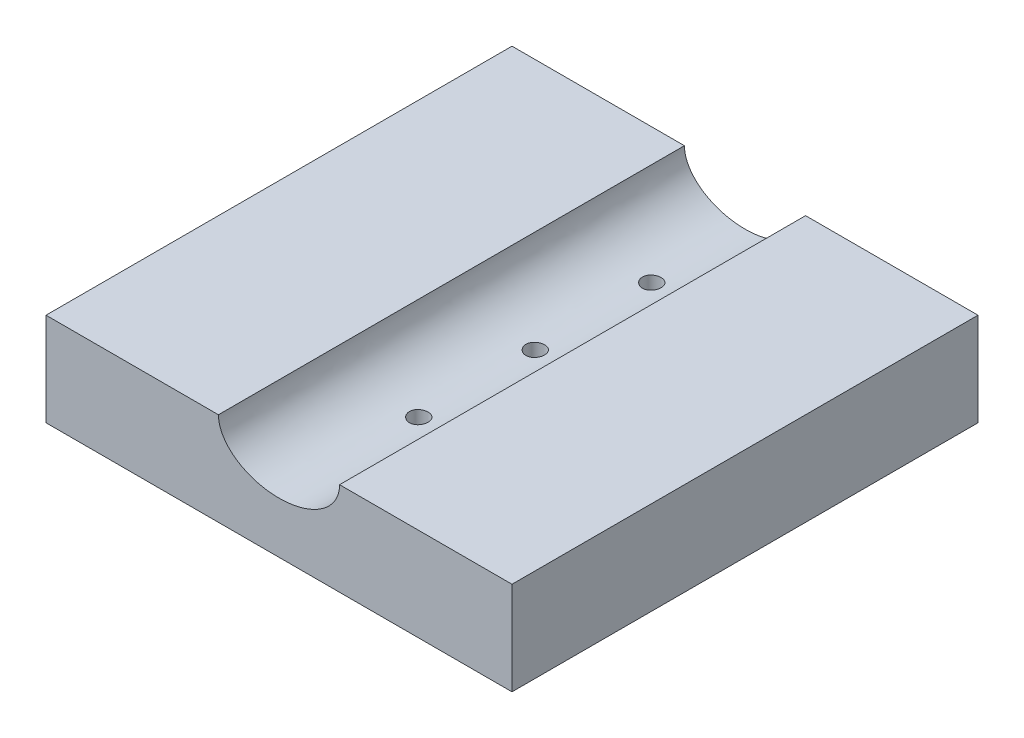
ISO-10303-21;
HEADER;
FILE_DESCRIPTION(('STEP AP214'),'2;1');
FILE_NAME('part.step','',(''),(''),'','','');
FILE_SCHEMA(('AUTOMOTIVE_DESIGN { 1 0 10303 214 1 1 1 1 }'));
ENDSEC;
DATA;
#1=APPLICATION_CONTEXT('core data for automotive mechanical design processes');
#2=APPLICATION_PROTOCOL_DEFINITION('international standard','automotive_design',2000,#1);
#3=PRODUCT_CONTEXT('',#1,'mechanical');
#4=PRODUCT('Part','Part','',(#3));
#5=PRODUCT_RELATED_PRODUCT_CATEGORY('part','',(#4));
#6=PRODUCT_DEFINITION_FORMATION('','',#4);
#7=PRODUCT_DEFINITION_CONTEXT('part definition',#1,'design');
#8=PRODUCT_DEFINITION('design','',#6,#7);
#9=PRODUCT_DEFINITION_SHAPE('','',#8);
#10=(LENGTH_UNIT() NAMED_UNIT(*) SI_UNIT(.MILLI.,.METRE.));
#11=(NAMED_UNIT(*) PLANE_ANGLE_UNIT() SI_UNIT($,.RADIAN.));
#12=(NAMED_UNIT(*) SI_UNIT($,.STERADIAN.) SOLID_ANGLE_UNIT());
#13=UNCERTAINTY_MEASURE_WITH_UNIT(LENGTH_MEASURE(1.E-05),#10,'distance_accuracy_value','');
#14=(GEOMETRIC_REPRESENTATION_CONTEXT(3) GLOBAL_UNCERTAINTY_ASSIGNED_CONTEXT((#13)) GLOBAL_UNIT_ASSIGNED_CONTEXT((#10,
#11,#12)) REPRESENTATION_CONTEXT('',''));
#15=CARTESIAN_POINT('',(0.,0.,0.));
#16=DIRECTION('',(0.,0.,1.));
#17=DIRECTION('',(1.,0.,0.));
#18=AXIS2_PLACEMENT_3D('',#15,#16,#17);
#19=CARTESIAN_POINT('',(-13.,0.,100.));
#20=DIRECTION('',(0.,-1.,0.));
#21=DIRECTION('',(1.,0.,0.));
#22=AXIS2_PLACEMENT_3D('',#19,#20,#21);
#23=PLANE('',#22);
#24=DIRECTION('',(-1.,0.,0.));
#25=VECTOR('',#24,1.);
#26=CARTESIAN_POINT('',(-13.,0.,0.));
#27=LINE('',#26,#25);
#28=CARTESIAN_POINT('',(-13.,0.,0.));
#29=VERTEX_POINT('',#28);
#30=CARTESIAN_POINT('',(-50.,0.,0.));
#31=VERTEX_POINT('',#30);
#32=EDGE_CURVE('E129',#29,#31,#27,.T.);
#33=ORIENTED_EDGE('',*,*,#32,.T.);
#34=DIRECTION('',(0.,0.,-1.));
#35=VECTOR('',#34,1.);
#36=CARTESIAN_POINT('',(-50.,0.,100.));
#37=LINE('',#36,#35);
#38=CARTESIAN_POINT('',(-50.,0.,100.));
#39=VERTEX_POINT('',#38);
#40=EDGE_CURVE('E11',#39,#31,#37,.T.);
#41=ORIENTED_EDGE('',*,*,#40,.F.);
#42=DIRECTION('',(-1.,0.,0.));
#43=VECTOR('',#42,1.);
#44=CARTESIAN_POINT('',(-13.,0.,100.));
#45=LINE('',#44,#43);
#46=CARTESIAN_POINT('',(-13.,0.,100.));
#47=VERTEX_POINT('',#46);
#48=EDGE_CURVE('E197',#47,#39,#45,.T.);
#49=ORIENTED_EDGE('',*,*,#48,.F.);
#50=DIRECTION('',(0.,0.,-1.));
#51=VECTOR('',#50,1.);
#52=CARTESIAN_POINT('',(-13.,0.,100.));
#53=LINE('',#52,#51);
#54=EDGE_CURVE('E124',#47,#29,#53,.T.);
#55=ORIENTED_EDGE('',*,*,#54,.T.);
#56=EDGE_LOOP('',(#33,#41,#49,#55));
#57=FACE_BOUND('',#56,.T.);
#58=ADVANCED_FACE('F37',(#57),#23,.F.);
#59=CARTESIAN_POINT('',(-50.,-20.,100.));
#60=DIRECTION('',(1.,0.,0.));
#61=DIRECTION('',(0.,1.,0.));
#62=AXIS2_PLACEMENT_3D('',#59,#60,#61);
#63=PLANE('',#62);
#64=DIRECTION('',(0.,-1.,0.));
#65=VECTOR('',#64,1.);
#66=CARTESIAN_POINT('',(-50.,-20.,0.));
#67=LINE('',#66,#65);
#68=CARTESIAN_POINT('',(-50.,-20.,0.));
#69=VERTEX_POINT('',#68);
#70=EDGE_CURVE('E182',#31,#69,#67,.T.);
#71=ORIENTED_EDGE('',*,*,#70,.T.);
#72=DIRECTION('',(0.,0.,-1.));
#73=VECTOR('',#72,1.);
#74=CARTESIAN_POINT('',(-50.,-20.,100.));
#75=LINE('',#74,#73);
#76=CARTESIAN_POINT('',(-50.,-20.,100.));
#77=VERTEX_POINT('',#76);
#78=EDGE_CURVE('E51',#77,#69,#75,.T.);
#79=ORIENTED_EDGE('',*,*,#78,.F.);
#80=DIRECTION('',(0.,-1.,0.));
#81=VECTOR('',#80,1.);
#82=CARTESIAN_POINT('',(-50.,-20.,100.));
#83=LINE('',#82,#81);
#84=EDGE_CURVE('E97',#39,#77,#83,.T.);
#85=ORIENTED_EDGE('',*,*,#84,.F.);
#86=ORIENTED_EDGE('',*,*,#40,.T.);
#87=EDGE_LOOP('',(#71,#79,#85,#86));
#88=FACE_BOUND('',#87,.T.);
#89=ADVANCED_FACE('F172',(#88),#63,.F.);
#90=CARTESIAN_POINT('',(50.,-20.,100.));
#91=DIRECTION('',(0.,1.,0.));
#92=DIRECTION('',(-1.,0.,0.));
#93=AXIS2_PLACEMENT_3D('',#90,#91,#92);
#94=PLANE('',#93);
#95=CARTESIAN_POINT('',(0.,-20.,45.));
#96=DIRECTION('',(0.,1.,0.));
#97=DIRECTION('',(0.,0.,1.));
#98=AXIS2_PLACEMENT_3D('',#95,#96,#97);
#99=CIRCLE('',#98,2.);
#100=CARTESIAN_POINT('',(0.,-20.,47.));
#101=VERTEX_POINT('',#100);
#102=EDGE_CURVE('E154',#101,#101,#99,.T.);
#103=ORIENTED_EDGE('',*,*,#102,.T.);
#104=EDGE_LOOP('',(#103));
#105=FACE_BOUND('',#104,.T.);
#106=CARTESIAN_POINT('',(0.,-20.,70.));
#107=DIRECTION('',(0.,1.,0.));
#108=DIRECTION('',(0.,0.,1.));
#109=AXIS2_PLACEMENT_3D('',#106,#107,#108);
#110=CIRCLE('',#109,2.);
#111=CARTESIAN_POINT('',(0.,-20.,72.));
#112=VERTEX_POINT('',#111);
#113=EDGE_CURVE('E195',#112,#112,#110,.T.);
#114=ORIENTED_EDGE('',*,*,#113,.T.);
#115=EDGE_LOOP('',(#114));
#116=FACE_BOUND('',#115,.T.);
#117=CARTESIAN_POINT('',(0.,-20.,20.));
#118=DIRECTION('',(0.,1.,0.));
#119=DIRECTION('',(0.,0.,1.));
#120=AXIS2_PLACEMENT_3D('',#117,#118,#119);
#121=CIRCLE('',#120,2.);
#122=CARTESIAN_POINT('',(0.,-20.,22.));
#123=VERTEX_POINT('',#122);
#124=EDGE_CURVE('E185',#123,#123,#121,.T.);
#125=ORIENTED_EDGE('',*,*,#124,.T.);
#126=EDGE_LOOP('',(#125));
#127=FACE_BOUND('',#126,.T.);
#128=DIRECTION('',(1.,0.,0.));
#129=VECTOR('',#128,1.);
#130=CARTESIAN_POINT('',(50.,-20.,0.));
#131=LINE('',#130,#129);
#132=CARTESIAN_POINT('',(50.,-20.,0.));
#133=VERTEX_POINT('',#132);
#134=EDGE_CURVE('E183',#69,#133,#131,.T.);
#135=ORIENTED_EDGE('',*,*,#134,.T.);
#136=DIRECTION('',(0.,0.,-1.));
#137=VECTOR('',#136,1.);
#138=CARTESIAN_POINT('',(50.,-20.,100.));
#139=LINE('',#138,#137);
#140=CARTESIAN_POINT('',(50.,-20.,100.));
#141=VERTEX_POINT('',#140);
#142=EDGE_CURVE('E119',#141,#133,#139,.T.);
#143=ORIENTED_EDGE('',*,*,#142,.F.);
#144=DIRECTION('',(1.,0.,0.));
#145=VECTOR('',#144,1.);
#146=CARTESIAN_POINT('',(50.,-20.,100.));
#147=LINE('',#146,#145);
#148=EDGE_CURVE('E110',#77,#141,#147,.T.);
#149=ORIENTED_EDGE('',*,*,#148,.F.);
#150=ORIENTED_EDGE('',*,*,#78,.T.);
#151=EDGE_LOOP('',(#135,#143,#149,#150));
#152=FACE_BOUND('',#151,.T.);
#153=ADVANCED_FACE('F177',(#105,#116,#127,#152),#94,.F.);
#154=CARTESIAN_POINT('',(50.,-20.,100.));
#155=DIRECTION('',(-1.,0.,0.));
#156=DIRECTION('',(0.,0.,1.));
#157=AXIS2_PLACEMENT_3D('',#154,#155,#156);
#158=PLANE('',#157);
#159=DIRECTION('',(0.,1.,0.));
#160=VECTOR('',#159,1.);
#161=CARTESIAN_POINT('',(50.,-20.,0.));
#162=LINE('',#161,#160);
#163=CARTESIAN_POINT('',(50.,0.,0.));
#164=VERTEX_POINT('',#163);
#165=EDGE_CURVE('E118',#133,#164,#162,.T.);
#166=ORIENTED_EDGE('',*,*,#165,.T.);
#167=DIRECTION('',(0.,0.,-1.));
#168=VECTOR('',#167,1.);
#169=CARTESIAN_POINT('',(50.,0.,100.));
#170=LINE('',#169,#168);
#171=CARTESIAN_POINT('',(50.,0.,100.));
#172=VERTEX_POINT('',#171);
#173=EDGE_CURVE('E115',#172,#164,#170,.T.);
#174=ORIENTED_EDGE('',*,*,#173,.F.);
#175=DIRECTION('',(0.,1.,0.));
#176=VECTOR('',#175,1.);
#177=CARTESIAN_POINT('',(50.,-20.,100.));
#178=LINE('',#177,#176);
#179=EDGE_CURVE('E104',#141,#172,#178,.T.);
#180=ORIENTED_EDGE('',*,*,#179,.F.);
#181=ORIENTED_EDGE('',*,*,#142,.T.);
#182=EDGE_LOOP('',(#166,#174,#180,#181));
#183=FACE_BOUND('',#182,.T.);
#184=ADVANCED_FACE('F116',(#183),#158,.F.);
#185=CARTESIAN_POINT('',(50.,0.,100.));
#186=DIRECTION('',(0.,-1.,0.));
#187=DIRECTION('',(1.,0.,0.));
#188=AXIS2_PLACEMENT_3D('',#185,#186,#187);
#189=PLANE('',#188);
#190=DIRECTION('',(-1.,0.,0.));
#191=VECTOR('',#190,1.);
#192=CARTESIAN_POINT('',(50.,0.,0.));
#193=LINE('',#192,#191);
#194=CARTESIAN_POINT('',(13.,0.,0.));
#195=VERTEX_POINT('',#194);
#196=EDGE_CURVE('E83',#164,#195,#193,.T.);
#197=ORIENTED_EDGE('',*,*,#196,.T.);
#198=DIRECTION('',(0.,0.,-1.));
#199=VECTOR('',#198,1.);
#200=CARTESIAN_POINT('',(13.,0.,100.));
#201=LINE('',#200,#199);
#202=CARTESIAN_POINT('',(13.,0.,100.));
#203=VERTEX_POINT('',#202);
#204=EDGE_CURVE('E120',#203,#195,#201,.T.);
#205=ORIENTED_EDGE('',*,*,#204,.F.);
#206=DIRECTION('',(-1.,0.,0.));
#207=VECTOR('',#206,1.);
#208=CARTESIAN_POINT('',(50.,0.,100.));
#209=LINE('',#208,#207);
#210=EDGE_CURVE('E108',#172,#203,#209,.T.);
#211=ORIENTED_EDGE('',*,*,#210,.F.);
#212=ORIENTED_EDGE('',*,*,#173,.T.);
#213=EDGE_LOOP('',(#197,#205,#211,#212));
#214=FACE_BOUND('',#213,.T.);
#215=ADVANCED_FACE('F122',(#214),#189,.F.);
#216=CARTESIAN_POINT('',(0.,0.,100.));
#217=DIRECTION('',(0.,0.,-1.));
#218=DIRECTION('',(1.,0.,0.));
#219=AXIS2_PLACEMENT_3D('',#216,#217,#218);
#220=ELLIPSE('',#219,13.,9.);
#221=DIRECTION('',(0.,0.,-1.));
#222=VECTOR('',#221,1.);
#223=SURFACE_OF_LINEAR_EXTRUSION('',#220,#222);
#224=CARTESIAN_POINT('',(0.,-9.,47.));
#225=CARTESIAN_POINT('',(-0.111999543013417,-8.99999864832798,46.9999951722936));
#226=CARTESIAN_POINT('',(-0.224072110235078,-8.99898743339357,46.9905603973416));
#227=CARTESIAN_POINT('',(-0.445107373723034,-8.99504972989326,46.9530672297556));
#228=CARTESIAN_POINT('',(-0.554066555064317,-8.99212115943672,46.9249885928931));
#229=CARTESIAN_POINT('',(-0.765642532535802,-8.98467647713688,46.8510368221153));
#230=CARTESIAN_POINT('',(-0.868263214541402,-8.98016134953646,46.8051747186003));
#231=CARTESIAN_POINT('',(-1.064328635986,-8.97004462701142,46.6969801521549));
#232=CARTESIAN_POINT('',(-1.15777513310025,-8.96444324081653,46.6346508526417));
#233=CARTESIAN_POINT('',(-1.3332401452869,-8.95275326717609,46.4950205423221));
#234=CARTESIAN_POINT('',(-1.41521621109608,-8.94666299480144,46.4176663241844));
#235=CARTESIAN_POINT('',(-1.56504873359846,-8.93469480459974,46.2502956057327));
#236=CARTESIAN_POINT('',(-1.63290451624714,-8.92881689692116,46.1602785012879));
#237=CARTESIAN_POINT('',(-1.75272513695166,-8.91792355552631,45.969865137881));
#238=CARTESIAN_POINT('',(-1.80465064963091,-8.91291026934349,45.8694439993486));
#239=CARTESIAN_POINT('',(-1.89088593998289,-8.90433816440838,45.6612451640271));
#240=CARTESIAN_POINT('',(-1.92519621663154,-8.90077930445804,45.5534676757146));
#241=CARTESIAN_POINT('',(-1.97509951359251,-8.89553757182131,45.334053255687));
#242=CARTESIAN_POINT('',(-1.99076374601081,-8.8938475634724,45.2224326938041));
#243=CARTESIAN_POINT('',(-2.00315035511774,-8.89251458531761,44.9981351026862));
#244=CARTESIAN_POINT('',(-1.99987330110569,-8.89287155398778,44.8854581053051));
#245=CARTESIAN_POINT('',(-1.97452955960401,-8.89558522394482,44.6627431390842));
#246=CARTESIAN_POINT('',(-1.95254155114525,-8.89793355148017,44.5526961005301));
#247=CARTESIAN_POINT('',(-1.89052247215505,-8.90434998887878,44.3378630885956));
#248=CARTESIAN_POINT('',(-1.8504911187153,-8.90841812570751,44.2330771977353));
#249=CARTESIAN_POINT('',(-1.75343506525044,-8.91782225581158,44.0314931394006));
#250=CARTESIAN_POINT('',(-1.69637558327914,-8.92316083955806,43.934711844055));
#251=CARTESIAN_POINT('',(-1.5669077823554,-8.93449949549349,43.7520692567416));
#252=CARTESIAN_POINT('',(-1.49449895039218,-8.94049958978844,43.6662083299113));
#253=CARTESIAN_POINT('',(-1.33595118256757,-8.95252121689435,43.507388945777));
#254=CARTESIAN_POINT('',(-1.24974463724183,-8.95854270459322,43.4344979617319));
#255=CARTESIAN_POINT('',(-1.06628301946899,-8.96990107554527,43.3042115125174));
#256=CARTESIAN_POINT('',(-0.969027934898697,-8.97523795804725,43.246816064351));
#257=CARTESIAN_POINT('',(-0.766185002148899,-8.98463050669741,43.1491534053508));
#258=CARTESIAN_POINT('',(-0.660595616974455,-8.98868593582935,43.1088893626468));
#259=CARTESIAN_POINT('',(-0.444102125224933,-8.9950593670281,43.0466805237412));
#260=CARTESIAN_POINT('',(-0.333198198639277,-8.99737742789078,43.0247351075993));
#261=CARTESIAN_POINT('',(-0.109802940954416,-9.00000959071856,42.9998717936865));
#262=CARTESIAN_POINT('',(0.00267801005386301,-9.00033341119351,42.9968616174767));
#263=CARTESIAN_POINT('',(0.226542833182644,-8.99896704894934,43.0097115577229));
#264=CARTESIAN_POINT('',(0.337926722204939,-8.9972768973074,43.025571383));
#265=CARTESIAN_POINT('',(0.556169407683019,-8.99207695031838,43.0756349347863));
#266=CARTESIAN_POINT('',(0.663038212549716,-8.98857143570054,43.1097955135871));
#267=CARTESIAN_POINT('',(0.869528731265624,-8.98013086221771,43.1954462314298));
#268=CARTESIAN_POINT('',(0.96915026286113,-8.97519576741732,43.2469368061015));
#269=CARTESIAN_POINT('',(1.15873220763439,-8.96442047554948,43.3660119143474));
#270=CARTESIAN_POINT('',(1.2486546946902,-8.9585769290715,43.4336565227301));
#271=CARTESIAN_POINT('',(1.41590201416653,-8.94664877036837,43.5830336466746));
#272=CARTESIAN_POINT('',(1.49322648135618,-8.9405641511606,43.6647665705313));
#273=CARTESIAN_POINT('',(1.63340630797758,-8.92881026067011,43.8404052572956));
#274=CARTESIAN_POINT('',(1.69620072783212,-8.92314280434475,43.934359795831));
#275=CARTESIAN_POINT('',(1.80511877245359,-8.91289572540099,44.1315353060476));
#276=CARTESIAN_POINT('',(1.85124265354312,-8.90831608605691,44.2347561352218));
#277=CARTESIAN_POINT('',(1.92540994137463,-8.90077814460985,44.4473306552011));
#278=CARTESIAN_POINT('',(1.95348878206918,-8.89781666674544,44.5566718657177));
#279=CARTESIAN_POINT('',(1.9908832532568,-8.89384354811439,44.7785505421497));
#280=CARTESIAN_POINT('',(2.00019951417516,-8.89283184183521,44.8910879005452));
#281=CARTESIAN_POINT('',(1.99979501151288,-8.89287539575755,45.115554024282));
#282=CARTESIAN_POINT('',(1.99017068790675,-8.89392018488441,45.2274829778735));
#283=CARTESIAN_POINT('',(1.95236091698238,-8.8979355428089,45.4481238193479));
#284=CARTESIAN_POINT('',(1.92417544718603,-8.90090611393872,45.5568357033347));
#285=CARTESIAN_POINT('',(1.85007093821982,-8.90843260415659,45.7679526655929));
#286=CARTESIAN_POINT('',(1.80415520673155,-8.91298822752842,45.8703589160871));
#287=CARTESIAN_POINT('',(1.69590310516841,-8.92316894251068,46.0660273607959));
#288=CARTESIAN_POINT('',(1.63356674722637,-8.9287940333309,46.1592895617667));
#289=CARTESIAN_POINT('',(1.49388122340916,-8.94051200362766,46.3345166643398));
#290=CARTESIAN_POINT('',(1.4164600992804,-8.94660703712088,46.4164240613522));
#291=CARTESIAN_POINT('',(1.24894832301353,-8.95855790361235,46.5661248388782));
#292=CARTESIAN_POINT('',(1.15885465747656,-8.96441367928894,46.6339148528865));
#293=CARTESIAN_POINT('',(0.968273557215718,-8.97524543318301,46.7536101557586));
#294=CARTESIAN_POINT('',(0.8677575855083,-8.98021888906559,46.8054702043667));
#295=CARTESIAN_POINT('',(0.659453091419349,-8.98870198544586,46.8915052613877));
#296=CARTESIAN_POINT('',(0.551672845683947,-8.99221326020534,46.9257000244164));
#297=CARTESIAN_POINT('',(0.369412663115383,-8.99650621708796,46.9669930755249));
#298=CARTESIAN_POINT('',(0.296094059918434,-8.99781026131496,46.9793535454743));
#299=CARTESIAN_POINT('',(0.148527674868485,-8.99955759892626,46.9958585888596));
#300=CARTESIAN_POINT('',(0.0742798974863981,-9.00000089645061,47.0000032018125));
#301=CARTESIAN_POINT('',(0.,-9.,47.));
#302=B_SPLINE_CURVE_WITH_KNOTS('',3,(#224,#225,#226,#227,#228,#229,#230,#231,#232,#233,#234,
#235,#236,#237,#238,#239,#240,#241,#242,#243,#244,#245,#246,#247,#248,#249,#250,#251,#252,#253,
#254,#255,#256,#257,#258,#259,#260,#261,#262,#263,#264,#265,#266,#267,#268,#269,#270,#271,#272,
#273,#274,#275,#276,#277,#278,#279,#280,#281,#282,#283,#284,#285,#286,#287,#288,#289,#290,#291,
#292,#293,#294,#295,#296,#297,#298,#299,#300,#301),.UNSPECIFIED.,.T.,.F.,(4,2,2,2,2,2,2,2,2,2,2,
2,2,2,2,2,2,2,2,2,2,2,2,2,2,2,2,2,2,2,2,2,2,2,2,2,2,2,4),(0.,0.335727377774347,0.67181989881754,
1.00770428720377,1.34352419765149,1.68055576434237,2.01760341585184,2.3554765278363,
2.69334006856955,3.02990907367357,3.36646796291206,3.70161858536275,4.03677446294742,
4.37261967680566,4.70847611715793,5.04603170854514,5.38358767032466,5.72120602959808,
6.05881296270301,6.39477332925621,6.73072851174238,7.06589507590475,7.4010700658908,
7.73751149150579,8.07396266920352,8.41180034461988,8.74963282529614,9.08679988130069,
9.42395560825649,9.75939907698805,10.0948429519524,10.4302242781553,10.7656053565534,
11.1026272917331,11.4397295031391,11.7777803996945,12.1154524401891,12.3381133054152,
12.5607730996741),.UNSPECIFIED.);
#303=CARTESIAN_POINT('',(0.,-9.,47.));
#304=VERTEX_POINT('',#303);
#305=EDGE_CURVE('E40',#304,#304,#302,.T.);
#306=ORIENTED_EDGE('',*,*,#305,.T.);
#307=EDGE_LOOP('',(#306));
#308=FACE_BOUND('',#307,.T.);
#309=CARTESIAN_POINT('',(0.,-9.,72.));
#310=CARTESIAN_POINT('',(-0.111999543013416,-8.99999864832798,71.9999951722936));
#311=CARTESIAN_POINT('',(-0.224072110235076,-8.99898743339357,71.9905603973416));
#312=CARTESIAN_POINT('',(-0.445107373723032,-8.99504972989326,71.9530672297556));
#313=CARTESIAN_POINT('',(-0.554066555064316,-8.99212115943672,71.9249885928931));
#314=CARTESIAN_POINT('',(-0.765642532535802,-8.98467647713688,71.8510368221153));
#315=CARTESIAN_POINT('',(-0.868263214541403,-8.98016134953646,71.8051747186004));
#316=CARTESIAN_POINT('',(-1.064328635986,-8.97004462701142,71.6969801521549));
#317=CARTESIAN_POINT('',(-1.15777513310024,-8.96444324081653,71.6346508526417));
#318=CARTESIAN_POINT('',(-1.33324014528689,-8.95275326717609,71.4950205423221));
#319=CARTESIAN_POINT('',(-1.41521621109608,-8.94666299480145,71.4176663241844));
#320=CARTESIAN_POINT('',(-1.56504873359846,-8.93469480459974,71.2502956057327));
#321=CARTESIAN_POINT('',(-1.63290451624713,-8.92881689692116,71.1602785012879));
#322=CARTESIAN_POINT('',(-1.75272513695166,-8.9179235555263,70.9698651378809));
#323=CARTESIAN_POINT('',(-1.80465064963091,-8.91291026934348,70.8694439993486));
#324=CARTESIAN_POINT('',(-1.8908859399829,-8.90433816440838,70.6612451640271));
#325=CARTESIAN_POINT('',(-1.92519621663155,-8.90077930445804,70.5534676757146));
#326=CARTESIAN_POINT('',(-1.97509951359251,-8.89553757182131,70.334053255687));
#327=CARTESIAN_POINT('',(-1.99076374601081,-8.8938475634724,70.2224326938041));
#328=CARTESIAN_POINT('',(-2.00315035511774,-8.89251458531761,69.9981351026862));
#329=CARTESIAN_POINT('',(-1.99987330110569,-8.89287155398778,69.8854581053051));
#330=CARTESIAN_POINT('',(-1.97452955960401,-8.89558522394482,69.6627431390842));
#331=CARTESIAN_POINT('',(-1.95254155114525,-8.89793355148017,69.5526961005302));
#332=CARTESIAN_POINT('',(-1.89052247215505,-8.90434998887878,69.3378630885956));
#333=CARTESIAN_POINT('',(-1.8504911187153,-8.90841812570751,69.2330771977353));
#334=CARTESIAN_POINT('',(-1.75343506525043,-8.91782225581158,69.0314931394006));
#335=CARTESIAN_POINT('',(-1.69637558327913,-8.92316083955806,68.934711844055));
#336=CARTESIAN_POINT('',(-1.5669077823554,-8.93449949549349,68.7520692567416));
#337=CARTESIAN_POINT('',(-1.49449895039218,-8.94049958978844,68.6662083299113));
#338=CARTESIAN_POINT('',(-1.33595118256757,-8.95252121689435,68.507388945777));
#339=CARTESIAN_POINT('',(-1.24974463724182,-8.95854270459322,68.4344979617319));
#340=CARTESIAN_POINT('',(-1.06628301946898,-8.96990107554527,68.3042115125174));
#341=CARTESIAN_POINT('',(-0.969027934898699,-8.97523795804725,68.246816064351));
#342=CARTESIAN_POINT('',(-0.766185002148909,-8.98463050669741,68.1491534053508));
#343=CARTESIAN_POINT('',(-0.660595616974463,-8.98868593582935,68.1088893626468));
#344=CARTESIAN_POINT('',(-0.444102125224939,-8.9950593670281,68.0466805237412));
#345=CARTESIAN_POINT('',(-0.333198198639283,-8.99737742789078,68.0247351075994));
#346=CARTESIAN_POINT('',(-0.109802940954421,-9.00000959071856,67.9998717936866));
#347=CARTESIAN_POINT('',(0.00267801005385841,-9.00033341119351,67.9968616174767));
#348=CARTESIAN_POINT('',(0.22654283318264,-8.99896704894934,68.0097115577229));
#349=CARTESIAN_POINT('',(0.337926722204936,-8.9972768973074,68.025571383));
#350=CARTESIAN_POINT('',(0.556169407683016,-8.99207695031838,68.0756349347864));
#351=CARTESIAN_POINT('',(0.663038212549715,-8.98857143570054,68.1097955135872));
#352=CARTESIAN_POINT('',(0.869528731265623,-8.98013086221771,68.1954462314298));
#353=CARTESIAN_POINT('',(0.969150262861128,-8.97519576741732,68.2469368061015));
#354=CARTESIAN_POINT('',(1.15873220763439,-8.96442047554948,68.3660119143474));
#355=CARTESIAN_POINT('',(1.2486546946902,-8.9585769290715,68.4336565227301));
#356=CARTESIAN_POINT('',(1.41590201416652,-8.94664877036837,68.5830336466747));
#357=CARTESIAN_POINT('',(1.49322648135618,-8.94056415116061,68.6647665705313));
#358=CARTESIAN_POINT('',(1.63340630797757,-8.92881026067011,68.8404052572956));
#359=CARTESIAN_POINT('',(1.69620072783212,-8.92314280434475,68.934359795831));
#360=CARTESIAN_POINT('',(1.80511877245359,-8.91289572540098,69.1315353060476));
#361=CARTESIAN_POINT('',(1.85124265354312,-8.90831608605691,69.2347561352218));
#362=CARTESIAN_POINT('',(1.92540994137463,-8.90077814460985,69.4473306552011));
#363=CARTESIAN_POINT('',(1.95348878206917,-8.89781666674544,69.5566718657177));
#364=CARTESIAN_POINT('',(1.9908832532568,-8.89384354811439,69.7785505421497));
#365=CARTESIAN_POINT('',(2.00019951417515,-8.89283184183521,69.8910879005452));
#366=CARTESIAN_POINT('',(1.99979501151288,-8.89287539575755,70.115554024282));
#367=CARTESIAN_POINT('',(1.99017068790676,-8.89392018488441,70.2274829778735));
#368=CARTESIAN_POINT('',(1.95236091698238,-8.8979355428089,70.4481238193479));
#369=CARTESIAN_POINT('',(1.92417544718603,-8.90090611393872,70.5568357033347));
#370=CARTESIAN_POINT('',(1.85007093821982,-8.90843260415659,70.7679526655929));
#371=CARTESIAN_POINT('',(1.80415520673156,-8.91298822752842,70.8703589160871));
#372=CARTESIAN_POINT('',(1.69590310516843,-8.92316894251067,71.0660273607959));
#373=CARTESIAN_POINT('',(1.63356674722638,-8.92879403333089,71.1592895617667));
#374=CARTESIAN_POINT('',(1.49388122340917,-8.94051200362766,71.3345166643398));
#375=CARTESIAN_POINT('',(1.41646009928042,-8.94660703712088,71.4164240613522));
#376=CARTESIAN_POINT('',(1.24894832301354,-8.95855790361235,71.5661248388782));
#377=CARTESIAN_POINT('',(1.15885465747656,-8.96441367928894,71.6339148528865));
#378=CARTESIAN_POINT('',(0.968273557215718,-8.97524543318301,71.7536101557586));
#379=CARTESIAN_POINT('',(0.867757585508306,-8.98021888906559,71.8054702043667));
#380=CARTESIAN_POINT('',(0.659453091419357,-8.98870198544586,71.8915052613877));
#381=CARTESIAN_POINT('',(0.551672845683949,-8.99221326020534,71.9257000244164));
#382=CARTESIAN_POINT('',(0.369412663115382,-8.99650621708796,71.9669930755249));
#383=CARTESIAN_POINT('',(0.296094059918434,-8.99781026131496,71.9793535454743));
#384=CARTESIAN_POINT('',(0.148527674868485,-8.99955759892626,71.9958585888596));
#385=CARTESIAN_POINT('',(0.0742798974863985,-9.00000089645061,72.0000032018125));
#386=CARTESIAN_POINT('',(0.,-9.,72.));
#387=B_SPLINE_CURVE_WITH_KNOTS('',3,(#309,#310,#311,#312,#313,#314,#315,#316,#317,#318,#319,
#320,#321,#322,#323,#324,#325,#326,#327,#328,#329,#330,#331,#332,#333,#334,#335,#336,#337,#338,
#339,#340,#341,#342,#343,#344,#345,#346,#347,#348,#349,#350,#351,#352,#353,#354,#355,#356,#357,
#358,#359,#360,#361,#362,#363,#364,#365,#366,#367,#368,#369,#370,#371,#372,#373,#374,#375,#376,
#377,#378,#379,#380,#381,#382,#383,#384,#385,#386),.UNSPECIFIED.,.T.,.F.,(4,2,2,2,2,2,2,2,2,2,2,
2,2,2,2,2,2,2,2,2,2,2,2,2,2,2,2,2,2,2,2,2,2,2,2,2,2,2,4),(0.,0.335727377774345,
0.671819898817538,1.00770428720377,1.34352419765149,1.68055576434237,2.01760341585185,
2.35547652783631,2.69334006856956,3.02990907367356,3.36646796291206,3.70161858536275,
4.03677446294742,4.37261967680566,4.70847611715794,5.04603170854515,5.38358767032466,
5.72120602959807,6.05881296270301,6.39477332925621,6.73072851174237,7.06589507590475,
7.4010700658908,7.73751149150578,8.07396266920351,8.41180034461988,8.74963282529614,
9.08679988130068,9.42395560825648,9.75939907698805,10.0948429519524,10.4302242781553,
10.7656053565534,11.102627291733,11.4397295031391,11.7777803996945,12.1154524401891,
12.3381133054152,12.5607730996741),.UNSPECIFIED.);
#388=CARTESIAN_POINT('',(0.,-9.,72.));
#389=VERTEX_POINT('',#388);
#390=EDGE_CURVE('E148',#389,#389,#387,.T.);
#391=ORIENTED_EDGE('',*,*,#390,.T.);
#392=EDGE_LOOP('',(#391));
#393=FACE_BOUND('',#392,.T.);
#394=CARTESIAN_POINT('',(0.,-9.,22.));
#395=CARTESIAN_POINT('',(-0.111999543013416,-8.99999864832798,21.9999951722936));
#396=CARTESIAN_POINT('',(-0.224072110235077,-8.99898743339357,21.9905603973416));
#397=CARTESIAN_POINT('',(-0.445107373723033,-8.99504972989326,21.9530672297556));
#398=CARTESIAN_POINT('',(-0.554066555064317,-8.99212115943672,21.9249885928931));
#399=CARTESIAN_POINT('',(-0.765642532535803,-8.98467647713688,21.8510368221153));
#400=CARTESIAN_POINT('',(-0.868263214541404,-8.98016134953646,21.8051747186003));
#401=CARTESIAN_POINT('',(-1.06432863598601,-8.97004462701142,21.6969801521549));
#402=CARTESIAN_POINT('',(-1.15777513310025,-8.96444324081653,21.6346508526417));
#403=CARTESIAN_POINT('',(-1.3332401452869,-8.95275326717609,21.495020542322));
#404=CARTESIAN_POINT('',(-1.41521621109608,-8.94666299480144,21.4176663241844));
#405=CARTESIAN_POINT('',(-1.56504873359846,-8.93469480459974,21.2502956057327));
#406=CARTESIAN_POINT('',(-1.63290451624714,-8.92881689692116,21.1602785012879));
#407=CARTESIAN_POINT('',(-1.75272513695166,-8.91792355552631,20.969865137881));
#408=CARTESIAN_POINT('',(-1.80465064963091,-8.91291026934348,20.8694439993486));
#409=CARTESIAN_POINT('',(-1.89088593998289,-8.90433816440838,20.6612451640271));
#410=CARTESIAN_POINT('',(-1.92519621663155,-8.90077930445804,20.5534676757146));
#411=CARTESIAN_POINT('',(-1.97509951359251,-8.89553757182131,20.334053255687));
#412=CARTESIAN_POINT('',(-1.99076374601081,-8.8938475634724,20.2224326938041));
#413=CARTESIAN_POINT('',(-2.00315035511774,-8.89251458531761,19.9981351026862));
#414=CARTESIAN_POINT('',(-1.99987330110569,-8.89287155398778,19.8854581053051));
#415=CARTESIAN_POINT('',(-1.97452955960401,-8.89558522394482,19.6627431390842));
#416=CARTESIAN_POINT('',(-1.95254155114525,-8.89793355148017,19.5526961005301));
#417=CARTESIAN_POINT('',(-1.89052247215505,-8.90434998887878,19.3378630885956));
#418=CARTESIAN_POINT('',(-1.8504911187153,-8.90841812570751,19.2330771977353));
#419=CARTESIAN_POINT('',(-1.75343506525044,-8.91782225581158,19.0314931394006));
#420=CARTESIAN_POINT('',(-1.69637558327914,-8.92316083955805,18.934711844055));
#421=CARTESIAN_POINT('',(-1.5669077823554,-8.93449949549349,18.7520692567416));
#422=CARTESIAN_POINT('',(-1.49449895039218,-8.94049958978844,18.6662083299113));
#423=CARTESIAN_POINT('',(-1.33595118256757,-8.95252121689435,18.507388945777));
#424=CARTESIAN_POINT('',(-1.24974463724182,-8.95854270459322,18.4344979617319));
#425=CARTESIAN_POINT('',(-1.06628301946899,-8.96990107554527,18.3042115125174));
#426=CARTESIAN_POINT('',(-0.969027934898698,-8.97523795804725,18.246816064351));
#427=CARTESIAN_POINT('',(-0.766185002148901,-8.98463050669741,18.1491534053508));
#428=CARTESIAN_POINT('',(-0.660595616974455,-8.98868593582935,18.1088893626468));
#429=CARTESIAN_POINT('',(-0.444102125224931,-8.9950593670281,18.0466805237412));
#430=CARTESIAN_POINT('',(-0.333198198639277,-8.99737742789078,18.0247351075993));
#431=CARTESIAN_POINT('',(-0.109802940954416,-9.00000959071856,17.9998717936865));
#432=CARTESIAN_POINT('',(0.00267801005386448,-9.00033341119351,17.9968616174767));
#433=CARTESIAN_POINT('',(0.226542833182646,-8.99896704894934,18.0097115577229));
#434=CARTESIAN_POINT('',(0.337926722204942,-8.9972768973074,18.025571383));
#435=CARTESIAN_POINT('',(0.556169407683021,-8.99207695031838,18.0756349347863));
#436=CARTESIAN_POINT('',(0.663038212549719,-8.98857143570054,18.1097955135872));
#437=CARTESIAN_POINT('',(0.869528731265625,-8.98013086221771,18.1954462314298));
#438=CARTESIAN_POINT('',(0.96915026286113,-8.97519576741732,18.2469368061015));
#439=CARTESIAN_POINT('',(1.15873220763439,-8.96442047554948,18.3660119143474));
#440=CARTESIAN_POINT('',(1.2486546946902,-8.9585769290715,18.4336565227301));
#441=CARTESIAN_POINT('',(1.41590201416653,-8.94664877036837,18.5830336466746));
#442=CARTESIAN_POINT('',(1.49322648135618,-8.9405641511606,18.6647665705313));
#443=CARTESIAN_POINT('',(1.63340630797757,-8.92881026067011,18.8404052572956));
#444=CARTESIAN_POINT('',(1.69620072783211,-8.92314280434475,18.934359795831));
#445=CARTESIAN_POINT('',(1.80511877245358,-8.91289572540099,19.1315353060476));
#446=CARTESIAN_POINT('',(1.85124265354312,-8.90831608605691,19.2347561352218));
#447=CARTESIAN_POINT('',(1.92540994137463,-8.90077814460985,19.4473306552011));
#448=CARTESIAN_POINT('',(1.95348878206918,-8.89781666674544,19.5566718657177));
#449=CARTESIAN_POINT('',(1.9908832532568,-8.89384354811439,19.7785505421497));
#450=CARTESIAN_POINT('',(2.00019951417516,-8.89283184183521,19.8910879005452));
#451=CARTESIAN_POINT('',(1.99979501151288,-8.89287539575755,20.115554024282));
#452=CARTESIAN_POINT('',(1.99017068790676,-8.89392018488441,20.2274829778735));
#453=CARTESIAN_POINT('',(1.95236091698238,-8.8979355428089,20.4481238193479));
#454=CARTESIAN_POINT('',(1.92417544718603,-8.90090611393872,20.5568357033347));
#455=CARTESIAN_POINT('',(1.85007093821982,-8.90843260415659,20.7679526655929));
#456=CARTESIAN_POINT('',(1.80415520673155,-8.91298822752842,20.8703589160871));
#457=CARTESIAN_POINT('',(1.69590310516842,-8.92316894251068,21.0660273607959));
#458=CARTESIAN_POINT('',(1.63356674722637,-8.9287940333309,21.1592895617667));
#459=CARTESIAN_POINT('',(1.49388122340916,-8.94051200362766,21.3345166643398));
#460=CARTESIAN_POINT('',(1.41646009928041,-8.94660703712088,21.4164240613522));
#461=CARTESIAN_POINT('',(1.24894832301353,-8.95855790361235,21.5661248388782));
#462=CARTESIAN_POINT('',(1.15885465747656,-8.96441367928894,21.6339148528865));
#463=CARTESIAN_POINT('',(0.968273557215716,-8.97524543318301,21.7536101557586));
#464=CARTESIAN_POINT('',(0.867757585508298,-8.98021888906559,21.8054702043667));
#465=CARTESIAN_POINT('',(0.659453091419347,-8.98870198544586,21.8915052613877));
#466=CARTESIAN_POINT('',(0.551672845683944,-8.99221326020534,21.9257000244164));
#467=CARTESIAN_POINT('',(0.36941266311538,-8.99650621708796,21.9669930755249));
#468=CARTESIAN_POINT('',(0.296094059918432,-8.99781026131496,21.9793535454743));
#469=CARTESIAN_POINT('',(0.148527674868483,-8.99955759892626,21.9958585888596));
#470=CARTESIAN_POINT('',(0.0742798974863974,-9.00000089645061,22.0000032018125));
#471=CARTESIAN_POINT('',(0.,-9.,22.));
#472=B_SPLINE_CURVE_WITH_KNOTS('',3,(#394,#395,#396,#397,#398,#399,#400,#401,#402,#403,#404,
#405,#406,#407,#408,#409,#410,#411,#412,#413,#414,#415,#416,#417,#418,#419,#420,#421,#422,#423,
#424,#425,#426,#427,#428,#429,#430,#431,#432,#433,#434,#435,#436,#437,#438,#439,#440,#441,#442,
#443,#444,#445,#446,#447,#448,#449,#450,#451,#452,#453,#454,#455,#456,#457,#458,#459,#460,#461,
#462,#463,#464,#465,#466,#467,#468,#469,#470,#471),.UNSPECIFIED.,.T.,.F.,(4,2,2,2,2,2,2,2,2,2,2,
2,2,2,2,2,2,2,2,2,2,2,2,2,2,2,2,2,2,2,2,2,2,2,2,2,2,2,4),(0.,0.335727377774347,
0.671819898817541,1.00770428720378,1.34352419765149,1.68055576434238,2.01760341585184,
2.35547652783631,2.69334006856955,3.02990907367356,3.36646796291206,3.70161858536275,
4.03677446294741,4.37261967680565,4.70847611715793,5.04603170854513,5.38358767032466,
5.72120602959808,6.05881296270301,6.39477332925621,6.73072851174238,7.06589507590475,
7.4010700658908,7.73751149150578,8.07396266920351,8.41180034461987,8.74963282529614,
9.08679988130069,9.42395560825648,9.75939907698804,10.0948429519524,10.4302242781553,
10.7656053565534,11.102627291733,11.4397295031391,11.7777803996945,12.1154524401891,
12.3381133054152,12.5607730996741),.UNSPECIFIED.);
#473=CARTESIAN_POINT('',(0.,-9.,22.));
#474=VERTEX_POINT('',#473);
#475=EDGE_CURVE('E143',#474,#474,#472,.T.);
#476=ORIENTED_EDGE('',*,*,#475,.T.);
#477=EDGE_LOOP('',(#476));
#478=FACE_BOUND('',#477,.T.);
#479=CARTESIAN_POINT('',(0.,0.,0.));
#480=DIRECTION('',(0.,0.,-1.));
#481=DIRECTION('',(1.,0.,0.));
#482=AXIS2_PLACEMENT_3D('',#479,#480,#481);
#483=ELLIPSE('',#482,13.,9.);
#484=EDGE_CURVE('E89',#195,#29,#483,.T.);
#485=ORIENTED_EDGE('',*,*,#484,.T.);
#486=ORIENTED_EDGE('',*,*,#54,.F.);
#487=EDGE_CURVE('E60',#203,#47,#220,.T.);
#488=ORIENTED_EDGE('',*,*,#487,.F.);
#489=ORIENTED_EDGE('',*,*,#204,.T.);
#490=EDGE_LOOP('',(#485,#486,#488,#489));
#491=FACE_BOUND('',#490,.T.);
#492=ADVANCED_FACE('F131',(#308,#393,#478,#491),#223,.F.);
#493=CARTESIAN_POINT('',(0.,0.,100.));
#494=DIRECTION('',(0.,0.,1.));
#495=DIRECTION('',(1.,0.,0.));
#496=AXIS2_PLACEMENT_3D('',#493,#494,#495);
#497=PLANE('',#496);
#498=ORIENTED_EDGE('',*,*,#48,.T.);
#499=ORIENTED_EDGE('',*,*,#84,.T.);
#500=ORIENTED_EDGE('',*,*,#148,.T.);
#501=ORIENTED_EDGE('',*,*,#179,.T.);
#502=ORIENTED_EDGE('',*,*,#210,.T.);
#503=ORIENTED_EDGE('',*,*,#487,.T.);
#504=EDGE_LOOP('',(#498,#499,#500,#501,#502,#503));
#505=FACE_BOUND('',#504,.T.);
#506=ADVANCED_FACE('F106',(#505),#497,.T.);
#507=CARTESIAN_POINT('',(0.,0.,0.));
#508=DIRECTION('',(0.,0.,1.));
#509=DIRECTION('',(1.,0.,0.));
#510=AXIS2_PLACEMENT_3D('',#507,#508,#509);
#511=PLANE('',#510);
#512=ORIENTED_EDGE('',*,*,#32,.F.);
#513=ORIENTED_EDGE('',*,*,#484,.F.);
#514=ORIENTED_EDGE('',*,*,#196,.F.);
#515=ORIENTED_EDGE('',*,*,#165,.F.);
#516=ORIENTED_EDGE('',*,*,#134,.F.);
#517=ORIENTED_EDGE('',*,*,#70,.F.);
#518=EDGE_LOOP('',(#512,#513,#514,#515,#516,#517));
#519=FACE_BOUND('',#518,.T.);
#520=ADVANCED_FACE('F137',(#519),#511,.F.);
#521=CARTESIAN_POINT('',(0.,-20.,20.));
#522=DIRECTION('',(0.,1.,0.));
#523=DIRECTION('',(0.,0.,1.));
#524=AXIS2_PLACEMENT_3D('',#521,#522,#523);
#525=CYLINDRICAL_SURFACE('',#524,2.);
#526=ORIENTED_EDGE('',*,*,#124,.F.);
#527=EDGE_LOOP('',(#526));
#528=FACE_BOUND('',#527,.T.);
#529=ORIENTED_EDGE('',*,*,#475,.F.);
#530=EDGE_LOOP('',(#529));
#531=FACE_BOUND('',#530,.T.);
#532=ADVANCED_FACE('F159',(#528,#531),#525,.F.);
#533=CARTESIAN_POINT('',(0.,-20.,70.));
#534=DIRECTION('',(0.,1.,0.));
#535=DIRECTION('',(0.,0.,1.));
#536=AXIS2_PLACEMENT_3D('',#533,#534,#535);
#537=CYLINDRICAL_SURFACE('',#536,2.);
#538=ORIENTED_EDGE('',*,*,#113,.F.);
#539=EDGE_LOOP('',(#538));
#540=FACE_BOUND('',#539,.T.);
#541=ORIENTED_EDGE('',*,*,#390,.F.);
#542=EDGE_LOOP('',(#541));
#543=FACE_BOUND('',#542,.T.);
#544=ADVANCED_FACE('F155',(#540,#543),#537,.F.);
#545=CARTESIAN_POINT('',(0.,-20.,45.));
#546=DIRECTION('',(0.,1.,0.));
#547=DIRECTION('',(0.,0.,1.));
#548=AXIS2_PLACEMENT_3D('',#545,#546,#547);
#549=CYLINDRICAL_SURFACE('',#548,2.);
#550=ORIENTED_EDGE('',*,*,#102,.F.);
#551=EDGE_LOOP('',(#550));
#552=FACE_BOUND('',#551,.T.);
#553=ORIENTED_EDGE('',*,*,#305,.F.);
#554=EDGE_LOOP('',(#553));
#555=FACE_BOUND('',#554,.T.);
#556=ADVANCED_FACE('F158',(#552,#555),#549,.F.);
#557=CLOSED_SHELL('',(#58,#89,#153,#184,#215,#492,#506,#520,#532,#544,#556));
#558=MANIFOLD_SOLID_BREP('B2',#557);
#559=ADVANCED_BREP_SHAPE_REPRESENTATION('',(#18,#558),#14);
#560=SHAPE_DEFINITION_REPRESENTATION(#9,#559);
ENDSEC;
END-ISO-10303-21;
